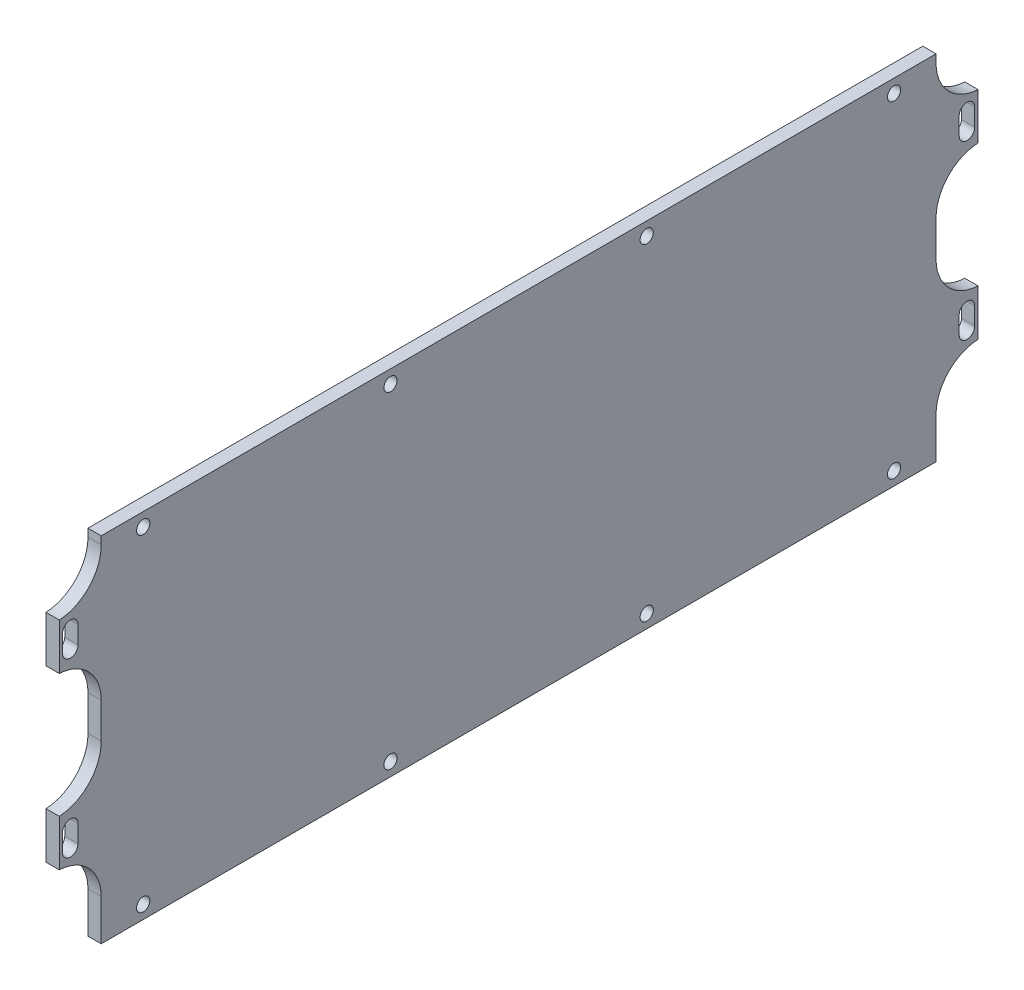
ISO-10303-21;
HEADER;
FILE_DESCRIPTION(('STEP AP214'),'2;1');
FILE_NAME('part.step','',(''),(''),'','','');
FILE_SCHEMA(('AUTOMOTIVE_DESIGN { 1 0 10303 214 1 1 1 1 }'));
ENDSEC;
DATA;
#1=APPLICATION_CONTEXT('core data for automotive mechanical design processes');
#2=APPLICATION_PROTOCOL_DEFINITION('international standard','automotive_design',2000,#1);
#3=PRODUCT_CONTEXT('',#1,'mechanical');
#4=PRODUCT('Part','Part','',(#3));
#5=PRODUCT_RELATED_PRODUCT_CATEGORY('part','',(#4));
#6=PRODUCT_DEFINITION_FORMATION('','',#4);
#7=PRODUCT_DEFINITION_CONTEXT('part definition',#1,'design');
#8=PRODUCT_DEFINITION('design','',#6,#7);
#9=PRODUCT_DEFINITION_SHAPE('','',#8);
#10=(LENGTH_UNIT() NAMED_UNIT(*) SI_UNIT(.MILLI.,.METRE.));
#11=(NAMED_UNIT(*) PLANE_ANGLE_UNIT() SI_UNIT($,.RADIAN.));
#12=(NAMED_UNIT(*) SI_UNIT($,.STERADIAN.) SOLID_ANGLE_UNIT());
#13=UNCERTAINTY_MEASURE_WITH_UNIT(LENGTH_MEASURE(1.E-05),#10,'distance_accuracy_value','');
#14=(GEOMETRIC_REPRESENTATION_CONTEXT(3) GLOBAL_UNCERTAINTY_ASSIGNED_CONTEXT((#13)) GLOBAL_UNIT_ASSIGNED_CONTEXT((#10,
#11,#12)) REPRESENTATION_CONTEXT('',''));
#15=CARTESIAN_POINT('',(0.,0.,0.));
#16=DIRECTION('',(0.,0.,1.));
#17=DIRECTION('',(1.,0.,0.));
#18=AXIS2_PLACEMENT_3D('',#15,#16,#17);
#19=CARTESIAN_POINT('',(-7.,21.25,-101.5));
#20=DIRECTION('',(1.,0.,0.));
#21=DIRECTION('',(0.,0.,-1.));
#22=AXIS2_PLACEMENT_3D('',#19,#20,#21);
#23=CYLINDRICAL_SURFACE('',#22,1.75);
#24=DIRECTION('',(1.,0.,0.));
#25=VECTOR('',#24,1.);
#26=CARTESIAN_POINT('',(0.,21.2500000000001,-99.75));
#27=LINE('',#26,#25);
#28=CARTESIAN_POINT('',(0.,21.2500000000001,-99.75));
#29=VERTEX_POINT('',#28);
#30=CARTESIAN_POINT('',(3.,21.2500000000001,-99.75));
#31=VERTEX_POINT('',#30);
#32=EDGE_CURVE('E301',#29,#31,#27,.T.);
#33=ORIENTED_EDGE('',*,*,#32,.T.);
#34=CARTESIAN_POINT('',(3.,21.25,-101.5));
#35=DIRECTION('',(1.,0.,0.));
#36=DIRECTION('',(0.,0.,-1.));
#37=AXIS2_PLACEMENT_3D('',#34,#35,#36);
#38=CIRCLE('',#37,1.75);
#39=CARTESIAN_POINT('',(3.,21.2500000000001,-103.25));
#40=VERTEX_POINT('',#39);
#41=EDGE_CURVE('E482',#31,#40,#38,.T.);
#42=ORIENTED_EDGE('',*,*,#41,.T.);
#43=DIRECTION('',(1.,0.,0.));
#44=VECTOR('',#43,1.);
#45=CARTESIAN_POINT('',(0.,21.2500000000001,-103.25));
#46=LINE('',#45,#44);
#47=CARTESIAN_POINT('',(0.,21.25,-103.25));
#48=VERTEX_POINT('',#47);
#49=EDGE_CURVE('E277',#48,#40,#46,.T.);
#50=ORIENTED_EDGE('',*,*,#49,.F.);
#51=CARTESIAN_POINT('',(0.,21.25,-101.5));
#52=DIRECTION('',(-1.,0.,0.));
#53=DIRECTION('',(0.,0.,1.));
#54=AXIS2_PLACEMENT_3D('',#51,#52,#53);
#55=CIRCLE('',#54,1.75);
#56=EDGE_CURVE('E291',#48,#29,#55,.T.);
#57=ORIENTED_EDGE('',*,*,#56,.T.);
#58=EDGE_LOOP('',(#33,#42,#50,#57));
#59=FACE_BOUND('',#58,.T.);
#60=ADVANCED_FACE('F34',(#59),#23,.F.);
#61=CARTESIAN_POINT('',(-7.,-17.75,-101.5));
#62=DIRECTION('',(1.,0.,0.));
#63=DIRECTION('',(0.,0.,-1.));
#64=AXIS2_PLACEMENT_3D('',#61,#62,#63);
#65=CYLINDRICAL_SURFACE('',#64,1.75);
#66=DIRECTION('',(1.,0.,0.));
#67=VECTOR('',#66,1.);
#68=CARTESIAN_POINT('',(0.,-17.75,-99.75));
#69=LINE('',#68,#67);
#70=CARTESIAN_POINT('',(0.,-17.75,-99.75));
#71=VERTEX_POINT('',#70);
#72=CARTESIAN_POINT('',(3.,-17.75,-99.75));
#73=VERTEX_POINT('',#72);
#74=EDGE_CURVE('E322',#71,#73,#69,.T.);
#75=ORIENTED_EDGE('',*,*,#74,.T.);
#76=CARTESIAN_POINT('',(3.,-17.75,-101.5));
#77=DIRECTION('',(1.,0.,0.));
#78=DIRECTION('',(0.,0.,-1.));
#79=AXIS2_PLACEMENT_3D('',#76,#77,#78);
#80=CIRCLE('',#79,1.75);
#81=CARTESIAN_POINT('',(3.,-17.75,-103.25));
#82=VERTEX_POINT('',#81);
#83=EDGE_CURVE('E473',#73,#82,#80,.T.);
#84=ORIENTED_EDGE('',*,*,#83,.T.);
#85=DIRECTION('',(1.,0.,0.));
#86=VECTOR('',#85,1.);
#87=CARTESIAN_POINT('',(0.,-17.75,-103.25));
#88=LINE('',#87,#86);
#89=CARTESIAN_POINT('',(0.,-17.75,-103.25));
#90=VERTEX_POINT('',#89);
#91=EDGE_CURVE('E343',#90,#82,#88,.T.);
#92=ORIENTED_EDGE('',*,*,#91,.F.);
#93=CARTESIAN_POINT('',(0.,-17.75,-101.5));
#94=DIRECTION('',(-1.,0.,0.));
#95=DIRECTION('',(0.,0.,1.));
#96=AXIS2_PLACEMENT_3D('',#93,#94,#95);
#97=CIRCLE('',#96,1.75);
#98=EDGE_CURVE('E485',#90,#71,#97,.T.);
#99=ORIENTED_EDGE('',*,*,#98,.T.);
#100=EDGE_LOOP('',(#75,#84,#92,#99));
#101=FACE_BOUND('',#100,.T.);
#102=ADVANCED_FACE('F684',(#101),#65,.F.);
#103=CARTESIAN_POINT('',(3.,0.,0.));
#104=DIRECTION('',(-1.,0.,0.));
#105=DIRECTION('',(0.,0.,1.));
#106=AXIS2_PLACEMENT_3D('',#103,#104,#105);
#107=PLANE('',#106);
#108=DIRECTION('',(0.,-1.,0.));
#109=VECTOR('',#108,1.);
#110=CARTESIAN_POINT('',(3.,0.,-104.));
#111=LINE('',#110,#109);
#112=CARTESIAN_POINT('',(3.,-10.25,-104.));
#113=VERTEX_POINT('',#112);
#114=CARTESIAN_POINT('',(3.,-20.75,-104.));
#115=VERTEX_POINT('',#114);
#116=EDGE_CURVE('E402',#113,#115,#111,.T.);
#117=ORIENTED_EDGE('',*,*,#116,.F.);
#118=CARTESIAN_POINT('',(3.,-0.262507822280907,-104.5));
#119=DIRECTION('',(-1.,0.,0.));
#120=DIRECTION('',(0.,0.,1.));
#121=AXIS2_PLACEMENT_3D('',#118,#119,#120);
#122=CIRCLE('',#121,10.);
#123=CARTESIAN_POINT('',(3.,-0.262507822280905,-94.5));
#124=VERTEX_POINT('',#123);
#125=EDGE_CURVE('E562',#113,#124,#122,.T.);
#126=ORIENTED_EDGE('',*,*,#125,.T.);
#127=DIRECTION('',(0.,-1.,0.));
#128=VECTOR('',#127,1.);
#129=CARTESIAN_POINT('',(3.,17.75,-94.5));
#130=LINE('',#129,#128);
#131=CARTESIAN_POINT('',(3.,7.76250782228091,-94.5));
#132=VERTEX_POINT('',#131);
#133=EDGE_CURVE('E445',#132,#124,#130,.T.);
#134=ORIENTED_EDGE('',*,*,#133,.F.);
#135=CARTESIAN_POINT('',(3.,7.76250782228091,-104.5));
#136=DIRECTION('',(-1.,0.,0.));
#137=DIRECTION('',(0.,0.,1.));
#138=AXIS2_PLACEMENT_3D('',#135,#136,#137);
#139=CIRCLE('',#138,10.);
#140=CARTESIAN_POINT('',(3.,17.75,-104.));
#141=VERTEX_POINT('',#140);
#142=EDGE_CURVE('E566',#132,#141,#139,.T.);
#143=ORIENTED_EDGE('',*,*,#142,.T.);
#144=CARTESIAN_POINT('',(3.,28.2499999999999,-104.));
#145=VERTEX_POINT('',#144);
#146=EDGE_CURVE('E398',#145,#141,#111,.T.);
#147=ORIENTED_EDGE('',*,*,#146,.F.);
#148=CARTESIAN_POINT('',(3.,38.237492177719,-104.5));
#149=DIRECTION('',(-1.,0.,0.));
#150=DIRECTION('',(0.,0.,1.));
#151=AXIS2_PLACEMENT_3D('',#148,#149,#150);
#152=CIRCLE('',#151,10.);
#153=CARTESIAN_POINT('',(3.,38.237492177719,-94.5));
#154=VERTEX_POINT('',#153);
#155=EDGE_CURVE('E570',#145,#154,#152,.T.);
#156=ORIENTED_EDGE('',*,*,#155,.T.);
#157=DIRECTION('',(0.,-1.,0.));
#158=VECTOR('',#157,1.);
#159=CARTESIAN_POINT('',(3.,24.25,-94.5));
#160=LINE('',#159,#158);
#161=CARTESIAN_POINT('',(3.,40.,-94.5));
#162=VERTEX_POINT('',#161);
#163=EDGE_CURVE('E462',#162,#154,#160,.T.);
#164=ORIENTED_EDGE('',*,*,#163,.F.);
#165=DIRECTION('',(0.,0.,-1.));
#166=VECTOR('',#165,1.);
#167=CARTESIAN_POINT('',(3.,40.,0.));
#168=LINE('',#167,#166);
#169=CARTESIAN_POINT('',(3.,40.,94.5));
#170=VERTEX_POINT('',#169);
#171=EDGE_CURVE('E467',#170,#162,#168,.T.);
#172=ORIENTED_EDGE('',*,*,#171,.F.);
#173=DIRECTION('',(0.,1.,0.));
#174=VECTOR('',#173,1.);
#175=CARTESIAN_POINT('',(3.,24.25,94.5));
#176=LINE('',#175,#174);
#177=CARTESIAN_POINT('',(3.,38.2374921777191,94.5));
#178=VERTEX_POINT('',#177);
#179=EDGE_CURVE('E448',#178,#170,#176,.T.);
#180=ORIENTED_EDGE('',*,*,#179,.F.);
#181=CARTESIAN_POINT('',(3.,38.2374921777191,104.5));
#182=DIRECTION('',(-1.,0.,0.));
#183=DIRECTION('',(0.,0.,1.));
#184=AXIS2_PLACEMENT_3D('',#181,#182,#183);
#185=CIRCLE('',#184,10.);
#186=CARTESIAN_POINT('',(3.,28.25,104.));
#187=VERTEX_POINT('',#186);
#188=EDGE_CURVE('E11',#178,#187,#185,.T.);
#189=ORIENTED_EDGE('',*,*,#188,.T.);
#190=DIRECTION('',(0.,1.,0.));
#191=VECTOR('',#190,1.);
#192=CARTESIAN_POINT('',(3.,0.,104.));
#193=LINE('',#192,#191);
#194=CARTESIAN_POINT('',(3.,17.75,104.));
#195=VERTEX_POINT('',#194);
#196=EDGE_CURVE('E407',#195,#187,#193,.T.);
#197=ORIENTED_EDGE('',*,*,#196,.F.);
#198=CARTESIAN_POINT('',(3.,7.76250782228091,104.5));
#199=DIRECTION('',(-1.,0.,0.));
#200=DIRECTION('',(0.,0.,1.));
#201=AXIS2_PLACEMENT_3D('',#198,#199,#200);
#202=CIRCLE('',#201,10.);
#203=CARTESIAN_POINT('',(3.,7.76250782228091,94.5));
#204=VERTEX_POINT('',#203);
#205=EDGE_CURVE('E582',#195,#204,#202,.T.);
#206=ORIENTED_EDGE('',*,*,#205,.T.);
#207=DIRECTION('',(0.,1.,0.));
#208=VECTOR('',#207,1.);
#209=CARTESIAN_POINT('',(3.,17.75,94.5));
#210=LINE('',#209,#208);
#211=CARTESIAN_POINT('',(3.,-0.262507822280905,94.5));
#212=VERTEX_POINT('',#211);
#213=EDGE_CURVE('E442',#212,#204,#210,.T.);
#214=ORIENTED_EDGE('',*,*,#213,.F.);
#215=CARTESIAN_POINT('',(3.,-0.262507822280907,104.5));
#216=DIRECTION('',(-1.,0.,0.));
#217=DIRECTION('',(0.,0.,1.));
#218=AXIS2_PLACEMENT_3D('',#215,#216,#217);
#219=CIRCLE('',#218,10.);
#220=CARTESIAN_POINT('',(3.,-10.25,104.));
#221=VERTEX_POINT('',#220);
#222=EDGE_CURVE('E580',#212,#221,#219,.T.);
#223=ORIENTED_EDGE('',*,*,#222,.T.);
#224=CARTESIAN_POINT('',(3.,-20.75,104.));
#225=VERTEX_POINT('',#224);
#226=EDGE_CURVE('E411',#225,#221,#193,.T.);
#227=ORIENTED_EDGE('',*,*,#226,.F.);
#228=CARTESIAN_POINT('',(3.,-30.7374921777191,104.5));
#229=DIRECTION('',(-1.,0.,0.));
#230=DIRECTION('',(0.,0.,1.));
#231=AXIS2_PLACEMENT_3D('',#228,#229,#230);
#232=CIRCLE('',#231,10.);
#233=CARTESIAN_POINT('',(3.,-30.7374921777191,94.5));
#234=VERTEX_POINT('',#233);
#235=EDGE_CURVE('E574',#225,#234,#232,.T.);
#236=ORIENTED_EDGE('',*,*,#235,.T.);
#237=DIRECTION('',(0.,1.,0.));
#238=VECTOR('',#237,1.);
#239=CARTESIAN_POINT('',(3.,-20.75,94.5));
#240=LINE('',#239,#238);
#241=CARTESIAN_POINT('',(3.,-40.,94.5));
#242=VERTEX_POINT('',#241);
#243=EDGE_CURVE('E452',#242,#234,#240,.T.);
#244=ORIENTED_EDGE('',*,*,#243,.F.);
#245=DIRECTION('',(0.,0.,1.));
#246=VECTOR('',#245,1.);
#247=CARTESIAN_POINT('',(3.,-40.,0.));
#248=LINE('',#247,#246);
#249=CARTESIAN_POINT('',(3.,-40.,-94.5));
#250=VERTEX_POINT('',#249);
#251=EDGE_CURVE('E469',#250,#242,#248,.T.);
#252=ORIENTED_EDGE('',*,*,#251,.F.);
#253=DIRECTION('',(0.,-1.,0.));
#254=VECTOR('',#253,1.);
#255=CARTESIAN_POINT('',(3.,-20.75,-94.5));
#256=LINE('',#255,#254);
#257=CARTESIAN_POINT('',(3.,-30.7374921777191,-94.5));
#258=VERTEX_POINT('',#257);
#259=EDGE_CURVE('E449',#258,#250,#256,.T.);
#260=ORIENTED_EDGE('',*,*,#259,.F.);
#261=CARTESIAN_POINT('',(3.,-30.7374921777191,-104.5));
#262=DIRECTION('',(-1.,0.,0.));
#263=DIRECTION('',(0.,0.,1.));
#264=AXIS2_PLACEMENT_3D('',#261,#262,#263);
#265=CIRCLE('',#264,10.);
#266=EDGE_CURVE('E558',#258,#115,#265,.T.);
#267=ORIENTED_EDGE('',*,*,#266,.T.);
#268=EDGE_LOOP('',(#117,#126,#134,#143,#147,#156,#164,#172,#180,#189,#197,#206,#214,#223,#227,
#236,#244,#252,#260,#267));
#269=FACE_BOUND('',#268,.T.);
#270=CARTESIAN_POINT('',(3.,37.,85.));
#271=DIRECTION('',(1.,0.,0.));
#272=DIRECTION('',(0.,0.,-1.));
#273=AXIS2_PLACEMENT_3D('',#270,#271,#272);
#274=CIRCLE('',#273,1.5);
#275=CARTESIAN_POINT('',(3.,37.,83.5));
#276=VERTEX_POINT('',#275);
#277=EDGE_CURVE('E416',#276,#276,#274,.T.);
#278=ORIENTED_EDGE('',*,*,#277,.F.);
#279=EDGE_LOOP('',(#278));
#280=FACE_BOUND('',#279,.T.);
#281=CARTESIAN_POINT('',(3.,37.,-85.));
#282=DIRECTION('',(1.,0.,0.));
#283=DIRECTION('',(0.,0.,1.));
#284=AXIS2_PLACEMENT_3D('',#281,#282,#283);
#285=CIRCLE('',#284,1.5);
#286=CARTESIAN_POINT('',(3.,37.,-83.5));
#287=VERTEX_POINT('',#286);
#288=EDGE_CURVE('E420',#287,#287,#285,.T.);
#289=ORIENTED_EDGE('',*,*,#288,.F.);
#290=EDGE_LOOP('',(#289));
#291=FACE_BOUND('',#290,.T.);
#292=CARTESIAN_POINT('',(3.,37.,-29.));
#293=DIRECTION('',(1.,0.,0.));
#294=DIRECTION('',(0.,0.,1.));
#295=AXIS2_PLACEMENT_3D('',#292,#293,#294);
#296=CIRCLE('',#295,1.5);
#297=CARTESIAN_POINT('',(3.,37.,-27.5));
#298=VERTEX_POINT('',#297);
#299=EDGE_CURVE('E423',#298,#298,#296,.T.);
#300=ORIENTED_EDGE('',*,*,#299,.F.);
#301=EDGE_LOOP('',(#300));
#302=FACE_BOUND('',#301,.T.);
#303=CARTESIAN_POINT('',(3.,-37.,85.));
#304=DIRECTION('',(1.,0.,0.));
#305=DIRECTION('',(0.,0.,1.));
#306=AXIS2_PLACEMENT_3D('',#303,#304,#305);
#307=CIRCLE('',#306,1.5);
#308=CARTESIAN_POINT('',(3.,-37.,86.5));
#309=VERTEX_POINT('',#308);
#310=EDGE_CURVE('E426',#309,#309,#307,.T.);
#311=ORIENTED_EDGE('',*,*,#310,.F.);
#312=EDGE_LOOP('',(#311));
#313=FACE_BOUND('',#312,.T.);
#314=CARTESIAN_POINT('',(3.,-37.,29.));
#315=DIRECTION('',(1.,0.,0.));
#316=DIRECTION('',(0.,0.,1.));
#317=AXIS2_PLACEMENT_3D('',#314,#315,#316);
#318=CIRCLE('',#317,1.5);
#319=CARTESIAN_POINT('',(3.,-37.,30.5));
#320=VERTEX_POINT('',#319);
#321=EDGE_CURVE('E429',#320,#320,#318,.T.);
#322=ORIENTED_EDGE('',*,*,#321,.F.);
#323=EDGE_LOOP('',(#322));
#324=FACE_BOUND('',#323,.T.);
#325=CARTESIAN_POINT('',(3.,-37.,-29.));
#326=DIRECTION('',(1.,0.,0.));
#327=DIRECTION('',(0.,0.,-1.));
#328=AXIS2_PLACEMENT_3D('',#325,#326,#327);
#329=CIRCLE('',#328,1.5);
#330=CARTESIAN_POINT('',(3.,-37.,-30.5));
#331=VERTEX_POINT('',#330);
#332=EDGE_CURVE('E432',#331,#331,#329,.T.);
#333=ORIENTED_EDGE('',*,*,#332,.F.);
#334=EDGE_LOOP('',(#333));
#335=FACE_BOUND('',#334,.T.);
#336=CARTESIAN_POINT('',(3.,-37.,-85.));
#337=DIRECTION('',(1.,0.,0.));
#338=DIRECTION('',(0.,0.,-1.));
#339=AXIS2_PLACEMENT_3D('',#336,#337,#338);
#340=CIRCLE('',#339,1.5);
#341=CARTESIAN_POINT('',(3.,-37.,-86.5));
#342=VERTEX_POINT('',#341);
#343=EDGE_CURVE('E415',#342,#342,#340,.T.);
#344=ORIENTED_EDGE('',*,*,#343,.F.);
#345=EDGE_LOOP('',(#344));
#346=FACE_BOUND('',#345,.T.);
#347=CARTESIAN_POINT('',(3.,37.,29.));
#348=DIRECTION('',(1.,0.,0.));
#349=DIRECTION('',(0.,0.,-1.));
#350=AXIS2_PLACEMENT_3D('',#347,#348,#349);
#351=CIRCLE('',#350,1.5);
#352=CARTESIAN_POINT('',(3.,37.,27.5));
#353=VERTEX_POINT('',#352);
#354=EDGE_CURVE('E437',#353,#353,#351,.T.);
#355=ORIENTED_EDGE('',*,*,#354,.F.);
#356=EDGE_LOOP('',(#355));
#357=FACE_BOUND('',#356,.T.);
#358=ORIENTED_EDGE('',*,*,#83,.F.);
#359=DIRECTION('',(0.,-1.,0.));
#360=VECTOR('',#359,1.);
#361=CARTESIAN_POINT('',(3.,-13.75,-99.75));
#362=LINE('',#361,#360);
#363=CARTESIAN_POINT('',(3.,-13.75,-99.75));
#364=VERTEX_POINT('',#363);
#365=EDGE_CURVE('E337',#364,#73,#362,.T.);
#366=ORIENTED_EDGE('',*,*,#365,.F.);
#367=CARTESIAN_POINT('',(3.,-13.75,-101.5));
#368=DIRECTION('',(1.,0.,0.));
#369=DIRECTION('',(0.,0.,1.));
#370=AXIS2_PLACEMENT_3D('',#367,#368,#369);
#371=CIRCLE('',#370,1.75);
#372=CARTESIAN_POINT('',(3.,-13.75,-103.25));
#373=VERTEX_POINT('',#372);
#374=EDGE_CURVE('E347',#373,#364,#371,.T.);
#375=ORIENTED_EDGE('',*,*,#374,.F.);
#376=DIRECTION('',(0.,1.,0.));
#377=VECTOR('',#376,1.);
#378=CARTESIAN_POINT('',(3.,-13.75,-103.25));
#379=LINE('',#378,#377);
#380=EDGE_CURVE('E344',#82,#373,#379,.T.);
#381=ORIENTED_EDGE('',*,*,#380,.F.);
#382=EDGE_LOOP('',(#358,#366,#375,#381));
#383=FACE_BOUND('',#382,.T.);
#384=CARTESIAN_POINT('',(3.,-13.75,101.5));
#385=DIRECTION('',(1.,0.,0.));
#386=DIRECTION('',(0.,0.,-1.));
#387=AXIS2_PLACEMENT_3D('',#384,#385,#386);
#388=CIRCLE('',#387,1.75);
#389=CARTESIAN_POINT('',(3.,-13.75,99.75));
#390=VERTEX_POINT('',#389);
#391=CARTESIAN_POINT('',(3.,-13.75,103.25));
#392=VERTEX_POINT('',#391);
#393=EDGE_CURVE('E318',#390,#392,#388,.T.);
#394=ORIENTED_EDGE('',*,*,#393,.F.);
#395=DIRECTION('',(0.,1.,0.));
#396=VECTOR('',#395,1.);
#397=CARTESIAN_POINT('',(3.,-13.75,99.75));
#398=LINE('',#397,#396);
#399=CARTESIAN_POINT('',(3.,-17.75,99.75));
#400=VERTEX_POINT('',#399);
#401=EDGE_CURVE('E311',#400,#390,#398,.T.);
#402=ORIENTED_EDGE('',*,*,#401,.F.);
#403=CARTESIAN_POINT('',(3.,-17.75,101.5));
#404=DIRECTION('',(1.,0.,0.));
#405=DIRECTION('',(0.,0.,1.));
#406=AXIS2_PLACEMENT_3D('',#403,#404,#405);
#407=CIRCLE('',#406,1.75);
#408=CARTESIAN_POINT('',(3.,-17.75,103.25));
#409=VERTEX_POINT('',#408);
#410=EDGE_CURVE('E477',#409,#400,#407,.T.);
#411=ORIENTED_EDGE('',*,*,#410,.F.);
#412=DIRECTION('',(0.,-1.,0.));
#413=VECTOR('',#412,1.);
#414=CARTESIAN_POINT('',(3.,-13.75,103.25));
#415=LINE('',#414,#413);
#416=EDGE_CURVE('E321',#392,#409,#415,.T.);
#417=ORIENTED_EDGE('',*,*,#416,.F.);
#418=EDGE_LOOP('',(#394,#402,#411,#417));
#419=FACE_BOUND('',#418,.T.);
#420=CARTESIAN_POINT('',(3.,25.2500000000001,101.5));
#421=DIRECTION('',(1.,0.,0.));
#422=DIRECTION('',(0.,0.,-1.));
#423=AXIS2_PLACEMENT_3D('',#420,#421,#422);
#424=CIRCLE('',#423,1.75);
#425=CARTESIAN_POINT('',(3.,25.2500000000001,99.75));
#426=VERTEX_POINT('',#425);
#427=CARTESIAN_POINT('',(3.,25.2500000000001,103.25));
#428=VERTEX_POINT('',#427);
#429=EDGE_CURVE('E304',#426,#428,#424,.T.);
#430=ORIENTED_EDGE('',*,*,#429,.F.);
#431=DIRECTION('',(0.,1.,0.));
#432=VECTOR('',#431,1.);
#433=CARTESIAN_POINT('',(3.,25.2500000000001,99.75));
#434=LINE('',#433,#432);
#435=CARTESIAN_POINT('',(3.,21.2500000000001,99.75));
#436=VERTEX_POINT('',#435);
#437=EDGE_CURVE('E362',#436,#426,#434,.T.);
#438=ORIENTED_EDGE('',*,*,#437,.F.);
#439=CARTESIAN_POINT('',(3.,21.2500000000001,101.5));
#440=DIRECTION('',(1.,0.,0.));
#441=DIRECTION('',(0.,0.,1.));
#442=AXIS2_PLACEMENT_3D('',#439,#440,#441);
#443=CIRCLE('',#442,1.75);
#444=CARTESIAN_POINT('',(3.,21.2500000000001,103.25));
#445=VERTEX_POINT('',#444);
#446=EDGE_CURVE('E472',#445,#436,#443,.T.);
#447=ORIENTED_EDGE('',*,*,#446,.F.);
#448=DIRECTION('',(0.,-1.,0.));
#449=VECTOR('',#448,1.);
#450=CARTESIAN_POINT('',(3.,25.2500000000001,103.25));
#451=LINE('',#450,#449);
#452=EDGE_CURVE('E371',#428,#445,#451,.T.);
#453=ORIENTED_EDGE('',*,*,#452,.F.);
#454=EDGE_LOOP('',(#430,#438,#447,#453));
#455=FACE_BOUND('',#454,.T.);
#456=ORIENTED_EDGE('',*,*,#41,.F.);
#457=DIRECTION('',(0.,-1.,0.));
#458=VECTOR('',#457,1.);
#459=CARTESIAN_POINT('',(3.,25.2500000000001,-99.75));
#460=LINE('',#459,#458);
#461=CARTESIAN_POINT('',(3.,25.2500000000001,-99.75));
#462=VERTEX_POINT('',#461);
#463=EDGE_CURVE('E292',#462,#31,#460,.T.);
#464=ORIENTED_EDGE('',*,*,#463,.F.);
#465=CARTESIAN_POINT('',(3.,25.2500000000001,-101.5));
#466=DIRECTION('',(1.,0.,0.));
#467=DIRECTION('',(0.,0.,1.));
#468=AXIS2_PLACEMENT_3D('',#465,#466,#467);
#469=CIRCLE('',#468,1.75);
#470=CARTESIAN_POINT('',(3.,25.2500000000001,-103.25));
#471=VERTEX_POINT('',#470);
#472=EDGE_CURVE('E294',#471,#462,#469,.T.);
#473=ORIENTED_EDGE('',*,*,#472,.F.);
#474=DIRECTION('',(0.,1.,0.));
#475=VECTOR('',#474,1.);
#476=CARTESIAN_POINT('',(3.,25.2500000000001,-103.25));
#477=LINE('',#476,#475);
#478=EDGE_CURVE('E272',#40,#471,#477,.T.);
#479=ORIENTED_EDGE('',*,*,#478,.F.);
#480=EDGE_LOOP('',(#456,#464,#473,#479));
#481=FACE_BOUND('',#480,.T.);
#482=ADVANCED_FACE('F601',(#269,#280,#291,#302,#313,#324,#335,#346,#357,#383,#419,#455,#481),
#107,.F.);
#483=CARTESIAN_POINT('',(0.,0.,0.));
#484=DIRECTION('',(-1.,0.,0.));
#485=DIRECTION('',(0.,0.,1.));
#486=AXIS2_PLACEMENT_3D('',#483,#484,#485);
#487=PLANE('',#486);
#488=DIRECTION('',(0.,-1.,0.));
#489=VECTOR('',#488,1.);
#490=CARTESIAN_POINT('',(0.,25.2500000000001,-99.75));
#491=LINE('',#490,#489);
#492=CARTESIAN_POINT('',(0.,25.2500000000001,-99.75));
#493=VERTEX_POINT('',#492);
#494=EDGE_CURVE('E285',#493,#29,#491,.T.);
#495=ORIENTED_EDGE('',*,*,#494,.T.);
#496=ORIENTED_EDGE('',*,*,#56,.F.);
#497=DIRECTION('',(0.,1.,0.));
#498=VECTOR('',#497,1.);
#499=CARTESIAN_POINT('',(0.,25.2500000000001,-103.25));
#500=LINE('',#499,#498);
#501=CARTESIAN_POINT('',(0.,25.2500000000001,-103.25));
#502=VERTEX_POINT('',#501);
#503=EDGE_CURVE('E269',#48,#502,#500,.T.);
#504=ORIENTED_EDGE('',*,*,#503,.T.);
#505=CARTESIAN_POINT('',(0.,25.2500000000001,-101.5));
#506=DIRECTION('',(1.,0.,0.));
#507=DIRECTION('',(0.,0.,1.));
#508=AXIS2_PLACEMENT_3D('',#505,#506,#507);
#509=CIRCLE('',#508,1.75);
#510=EDGE_CURVE('E280',#502,#493,#509,.T.);
#511=ORIENTED_EDGE('',*,*,#510,.T.);
#512=EDGE_LOOP('',(#495,#496,#504,#511));
#513=FACE_BOUND('',#512,.T.);
#514=DIRECTION('',(0.,1.,0.));
#515=VECTOR('',#514,1.);
#516=CARTESIAN_POINT('',(0.,-13.75,99.75));
#517=LINE('',#516,#515);
#518=CARTESIAN_POINT('',(0.,-17.75,99.75));
#519=VERTEX_POINT('',#518);
#520=CARTESIAN_POINT('',(0.,-13.75,99.75));
#521=VERTEX_POINT('',#520);
#522=EDGE_CURVE('E314',#519,#521,#517,.T.);
#523=ORIENTED_EDGE('',*,*,#522,.T.);
#524=CARTESIAN_POINT('',(0.,-13.75,101.5));
#525=DIRECTION('',(1.,0.,0.));
#526=DIRECTION('',(0.,0.,-1.));
#527=AXIS2_PLACEMENT_3D('',#524,#525,#526);
#528=CIRCLE('',#527,1.75);
#529=CARTESIAN_POINT('',(0.,-13.75,103.25));
#530=VERTEX_POINT('',#529);
#531=EDGE_CURVE('E307',#521,#530,#528,.T.);
#532=ORIENTED_EDGE('',*,*,#531,.T.);
#533=DIRECTION('',(0.,-1.,0.));
#534=VECTOR('',#533,1.);
#535=CARTESIAN_POINT('',(0.,-13.75,103.25));
#536=LINE('',#535,#534);
#537=CARTESIAN_POINT('',(0.,-17.75,103.25));
#538=VERTEX_POINT('',#537);
#539=EDGE_CURVE('E310',#530,#538,#536,.T.);
#540=ORIENTED_EDGE('',*,*,#539,.T.);
#541=CARTESIAN_POINT('',(0.,-17.75,101.5));
#542=DIRECTION('',(-1.,0.,0.));
#543=DIRECTION('',(0.,0.,1.));
#544=AXIS2_PLACEMENT_3D('',#541,#542,#543);
#545=CIRCLE('',#544,1.75);
#546=EDGE_CURVE('E490',#519,#538,#545,.T.);
#547=ORIENTED_EDGE('',*,*,#546,.F.);
#548=EDGE_LOOP('',(#523,#532,#540,#547));
#549=FACE_BOUND('',#548,.T.);
#550=DIRECTION('',(0.,-1.,0.));
#551=VECTOR('',#550,1.);
#552=CARTESIAN_POINT('',(0.,-13.75,-99.75));
#553=LINE('',#552,#551);
#554=CARTESIAN_POINT('',(0.,-13.75,-99.75));
#555=VERTEX_POINT('',#554);
#556=EDGE_CURVE('E340',#555,#71,#553,.T.);
#557=ORIENTED_EDGE('',*,*,#556,.T.);
#558=ORIENTED_EDGE('',*,*,#98,.F.);
#559=DIRECTION('',(0.,1.,0.));
#560=VECTOR('',#559,1.);
#561=CARTESIAN_POINT('',(0.,-13.75,-103.25));
#562=LINE('',#561,#560);
#563=CARTESIAN_POINT('',(0.,-13.75,-103.25));
#564=VERTEX_POINT('',#563);
#565=EDGE_CURVE('E333',#90,#564,#562,.T.);
#566=ORIENTED_EDGE('',*,*,#565,.T.);
#567=CARTESIAN_POINT('',(0.,-13.75,-101.5));
#568=DIRECTION('',(1.,0.,0.));
#569=DIRECTION('',(0.,0.,1.));
#570=AXIS2_PLACEMENT_3D('',#567,#568,#569);
#571=CIRCLE('',#570,1.75);
#572=EDGE_CURVE('E336',#564,#555,#571,.T.);
#573=ORIENTED_EDGE('',*,*,#572,.T.);
#574=EDGE_LOOP('',(#557,#558,#566,#573));
#575=FACE_BOUND('',#574,.T.);
#576=DIRECTION('',(0.,1.,0.));
#577=VECTOR('',#576,1.);
#578=CARTESIAN_POINT('',(0.,25.2500000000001,99.75));
#579=LINE('',#578,#577);
#580=CARTESIAN_POINT('',(0.,21.2500000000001,99.75));
#581=VERTEX_POINT('',#580);
#582=CARTESIAN_POINT('',(0.,25.2500000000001,99.75));
#583=VERTEX_POINT('',#582);
#584=EDGE_CURVE('E365',#581,#583,#579,.T.);
#585=ORIENTED_EDGE('',*,*,#584,.T.);
#586=CARTESIAN_POINT('',(0.,25.2500000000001,101.5));
#587=DIRECTION('',(1.,0.,0.));
#588=DIRECTION('',(0.,0.,-1.));
#589=AXIS2_PLACEMENT_3D('',#586,#587,#588);
#590=CIRCLE('',#589,1.75);
#591=CARTESIAN_POINT('',(0.,25.2500000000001,103.25));
#592=VERTEX_POINT('',#591);
#593=EDGE_CURVE('E358',#583,#592,#590,.T.);
#594=ORIENTED_EDGE('',*,*,#593,.T.);
#595=DIRECTION('',(0.,-1.,0.));
#596=VECTOR('',#595,1.);
#597=CARTESIAN_POINT('',(0.,25.2500000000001,103.25));
#598=LINE('',#597,#596);
#599=CARTESIAN_POINT('',(0.,21.2500000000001,103.25));
#600=VERTEX_POINT('',#599);
#601=EDGE_CURVE('E361',#592,#600,#598,.T.);
#602=ORIENTED_EDGE('',*,*,#601,.T.);
#603=CARTESIAN_POINT('',(0.,21.2500000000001,101.5));
#604=DIRECTION('',(-1.,0.,0.));
#605=DIRECTION('',(0.,0.,1.));
#606=AXIS2_PLACEMENT_3D('',#603,#604,#605);
#607=CIRCLE('',#606,1.75);
#608=EDGE_CURVE('E476',#581,#600,#607,.T.);
#609=ORIENTED_EDGE('',*,*,#608,.F.);
#610=EDGE_LOOP('',(#585,#594,#602,#609));
#611=FACE_BOUND('',#610,.T.);
#612=DIRECTION('',(0.,1.,0.));
#613=VECTOR('',#612,1.);
#614=CARTESIAN_POINT('',(0.,0.,104.));
#615=LINE('',#614,#613);
#616=CARTESIAN_POINT('',(0.,-20.75,104.));
#617=VERTEX_POINT('',#616);
#618=CARTESIAN_POINT('',(0.,-10.25,104.));
#619=VERTEX_POINT('',#618);
#620=EDGE_CURVE('E408',#617,#619,#615,.T.);
#621=ORIENTED_EDGE('',*,*,#620,.T.);
#622=CARTESIAN_POINT('',(0.,-0.262507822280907,104.5));
#623=DIRECTION('',(-1.,0.,0.));
#624=DIRECTION('',(0.,0.,1.));
#625=AXIS2_PLACEMENT_3D('',#622,#623,#624);
#626=CIRCLE('',#625,10.);
#627=CARTESIAN_POINT('',(0.,-0.262507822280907,94.5));
#628=VERTEX_POINT('',#627);
#629=EDGE_CURVE('E578',#619,#628,#626,.F.);
#630=ORIENTED_EDGE('',*,*,#629,.T.);
#631=DIRECTION('',(0.,-1.,0.));
#632=VECTOR('',#631,1.);
#633=CARTESIAN_POINT('',(0.,0.,94.5));
#634=LINE('',#633,#632);
#635=CARTESIAN_POINT('',(0.,7.76250782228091,94.5));
#636=VERTEX_POINT('',#635);
#637=EDGE_CURVE('E512',#636,#628,#634,.T.);
#638=ORIENTED_EDGE('',*,*,#637,.F.);
#639=CARTESIAN_POINT('',(0.,7.76250782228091,104.5));
#640=DIRECTION('',(-1.,0.,0.));
#641=DIRECTION('',(0.,0.,1.));
#642=AXIS2_PLACEMENT_3D('',#639,#640,#641);
#643=CIRCLE('',#642,10.);
#644=CARTESIAN_POINT('',(0.,17.75,104.));
#645=VERTEX_POINT('',#644);
#646=EDGE_CURVE('E584',#636,#645,#643,.F.);
#647=ORIENTED_EDGE('',*,*,#646,.T.);
#648=CARTESIAN_POINT('',(0.,28.25,104.));
#649=VERTEX_POINT('',#648);
#650=EDGE_CURVE('E405',#645,#649,#615,.T.);
#651=ORIENTED_EDGE('',*,*,#650,.T.);
#652=CARTESIAN_POINT('',(0.,38.2374921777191,104.5));
#653=DIRECTION('',(-1.,0.,0.));
#654=DIRECTION('',(0.,0.,1.));
#655=AXIS2_PLACEMENT_3D('',#652,#653,#654);
#656=CIRCLE('',#655,10.);
#657=CARTESIAN_POINT('',(0.,38.2374921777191,94.5));
#658=VERTEX_POINT('',#657);
#659=EDGE_CURVE('E42',#649,#658,#656,.F.);
#660=ORIENTED_EDGE('',*,*,#659,.T.);
#661=DIRECTION('',(0.,-1.,0.));
#662=VECTOR('',#661,1.);
#663=CARTESIAN_POINT('',(0.,0.,94.5));
#664=LINE('',#663,#662);
#665=CARTESIAN_POINT('',(0.,40.,94.5));
#666=VERTEX_POINT('',#665);
#667=EDGE_CURVE('E451',#666,#658,#664,.T.);
#668=ORIENTED_EDGE('',*,*,#667,.F.);
#669=DIRECTION('',(0.,0.,-1.));
#670=VECTOR('',#669,1.);
#671=CARTESIAN_POINT('',(0.,40.,0.));
#672=LINE('',#671,#670);
#673=CARTESIAN_POINT('',(0.,40.,-94.5));
#674=VERTEX_POINT('',#673);
#675=EDGE_CURVE('E497',#666,#674,#672,.T.);
#676=ORIENTED_EDGE('',*,*,#675,.T.);
#677=DIRECTION('',(0.,1.,0.));
#678=VECTOR('',#677,1.);
#679=CARTESIAN_POINT('',(0.,0.,-94.5));
#680=LINE('',#679,#678);
#681=CARTESIAN_POINT('',(0.,38.237492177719,-94.5));
#682=VERTEX_POINT('',#681);
#683=EDGE_CURVE('E465',#682,#674,#680,.T.);
#684=ORIENTED_EDGE('',*,*,#683,.F.);
#685=CARTESIAN_POINT('',(0.,38.237492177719,-104.5));
#686=DIRECTION('',(-1.,0.,0.));
#687=DIRECTION('',(0.,0.,1.));
#688=AXIS2_PLACEMENT_3D('',#685,#686,#687);
#689=CIRCLE('',#688,10.);
#690=CARTESIAN_POINT('',(0.,28.2499999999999,-104.));
#691=VERTEX_POINT('',#690);
#692=EDGE_CURVE('E572',#682,#691,#689,.F.);
#693=ORIENTED_EDGE('',*,*,#692,.T.);
#694=DIRECTION('',(0.,-1.,0.));
#695=VECTOR('',#694,1.);
#696=CARTESIAN_POINT('',(0.,0.,-104.));
#697=LINE('',#696,#695);
#698=CARTESIAN_POINT('',(0.,17.75,-104.));
#699=VERTEX_POINT('',#698);
#700=EDGE_CURVE('E395',#691,#699,#697,.T.);
#701=ORIENTED_EDGE('',*,*,#700,.T.);
#702=CARTESIAN_POINT('',(0.,7.76250782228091,-104.5));
#703=DIRECTION('',(-1.,0.,0.));
#704=DIRECTION('',(0.,0.,1.));
#705=AXIS2_PLACEMENT_3D('',#702,#703,#704);
#706=CIRCLE('',#705,10.);
#707=CARTESIAN_POINT('',(0.,7.76250782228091,-94.5));
#708=VERTEX_POINT('',#707);
#709=EDGE_CURVE('E568',#699,#708,#706,.F.);
#710=ORIENTED_EDGE('',*,*,#709,.T.);
#711=DIRECTION('',(0.,1.,0.));
#712=VECTOR('',#711,1.);
#713=CARTESIAN_POINT('',(0.,0.,-94.5));
#714=LINE('',#713,#712);
#715=CARTESIAN_POINT('',(0.,-0.262507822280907,-94.5));
#716=VERTEX_POINT('',#715);
#717=EDGE_CURVE('E509',#716,#708,#714,.T.);
#718=ORIENTED_EDGE('',*,*,#717,.F.);
#719=CARTESIAN_POINT('',(0.,-0.262507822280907,-104.5));
#720=DIRECTION('',(-1.,0.,0.));
#721=DIRECTION('',(0.,0.,1.));
#722=AXIS2_PLACEMENT_3D('',#719,#720,#721);
#723=CIRCLE('',#722,10.);
#724=CARTESIAN_POINT('',(0.,-10.25,-104.));
#725=VERTEX_POINT('',#724);
#726=EDGE_CURVE('E564',#716,#725,#723,.F.);
#727=ORIENTED_EDGE('',*,*,#726,.T.);
#728=CARTESIAN_POINT('',(0.,-20.75,-104.));
#729=VERTEX_POINT('',#728);
#730=EDGE_CURVE('E399',#725,#729,#697,.T.);
#731=ORIENTED_EDGE('',*,*,#730,.T.);
#732=CARTESIAN_POINT('',(0.,-30.7374921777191,-104.5));
#733=DIRECTION('',(-1.,0.,0.));
#734=DIRECTION('',(0.,0.,1.));
#735=AXIS2_PLACEMENT_3D('',#732,#733,#734);
#736=CIRCLE('',#735,10.);
#737=CARTESIAN_POINT('',(0.,-30.7374921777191,-94.5));
#738=VERTEX_POINT('',#737);
#739=EDGE_CURVE('E560',#729,#738,#736,.F.);
#740=ORIENTED_EDGE('',*,*,#739,.T.);
#741=DIRECTION('',(0.,1.,0.));
#742=VECTOR('',#741,1.);
#743=CARTESIAN_POINT('',(0.,0.,-94.5));
#744=LINE('',#743,#742);
#745=CARTESIAN_POINT('',(0.,-40.,-94.5));
#746=VERTEX_POINT('',#745);
#747=EDGE_CURVE('E459',#746,#738,#744,.T.);
#748=ORIENTED_EDGE('',*,*,#747,.F.);
#749=DIRECTION('',(0.,0.,1.));
#750=VECTOR('',#749,1.);
#751=CARTESIAN_POINT('',(0.,-40.,0.));
#752=LINE('',#751,#750);
#753=CARTESIAN_POINT('',(0.,-40.,94.5));
#754=VERTEX_POINT('',#753);
#755=EDGE_CURVE('E487',#746,#754,#752,.T.);
#756=ORIENTED_EDGE('',*,*,#755,.T.);
#757=DIRECTION('',(0.,-1.,0.));
#758=VECTOR('',#757,1.);
#759=CARTESIAN_POINT('',(0.,0.,94.5));
#760=LINE('',#759,#758);
#761=CARTESIAN_POINT('',(0.,-30.7374921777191,94.5));
#762=VERTEX_POINT('',#761);
#763=EDGE_CURVE('E457',#762,#754,#760,.T.);
#764=ORIENTED_EDGE('',*,*,#763,.F.);
#765=CARTESIAN_POINT('',(0.,-30.7374921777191,104.5));
#766=DIRECTION('',(-1.,0.,0.));
#767=DIRECTION('',(0.,0.,1.));
#768=AXIS2_PLACEMENT_3D('',#765,#766,#767);
#769=CIRCLE('',#768,10.);
#770=EDGE_CURVE('E576',#762,#617,#769,.F.);
#771=ORIENTED_EDGE('',*,*,#770,.T.);
#772=EDGE_LOOP('',(#621,#630,#638,#647,#651,#660,#668,#676,#684,#693,#701,#710,#718,#727,#731,
#740,#748,#756,#764,#771));
#773=FACE_BOUND('',#772,.T.);
#774=CARTESIAN_POINT('',(0.,37.,85.));
#775=DIRECTION('',(-1.,0.,0.));
#776=DIRECTION('',(0.,0.,1.));
#777=AXIS2_PLACEMENT_3D('',#774,#775,#776);
#778=CIRCLE('',#777,1.5);
#779=CARTESIAN_POINT('',(0.,37.,86.5));
#780=VERTEX_POINT('',#779);
#781=EDGE_CURVE('E441',#780,#780,#778,.T.);
#782=ORIENTED_EDGE('',*,*,#781,.F.);
#783=EDGE_LOOP('',(#782));
#784=FACE_BOUND('',#783,.T.);
#785=CARTESIAN_POINT('',(0.,37.,-85.));
#786=DIRECTION('',(-1.,0.,0.));
#787=DIRECTION('',(0.,0.,1.));
#788=AXIS2_PLACEMENT_3D('',#785,#786,#787);
#789=CIRCLE('',#788,1.5);
#790=CARTESIAN_POINT('',(0.,37.,-83.5));
#791=VERTEX_POINT('',#790);
#792=EDGE_CURVE('E532',#791,#791,#789,.T.);
#793=ORIENTED_EDGE('',*,*,#792,.F.);
#794=EDGE_LOOP('',(#793));
#795=FACE_BOUND('',#794,.T.);
#796=CARTESIAN_POINT('',(0.,37.,-29.));
#797=DIRECTION('',(-1.,0.,0.));
#798=DIRECTION('',(0.,0.,1.));
#799=AXIS2_PLACEMENT_3D('',#796,#797,#798);
#800=CIRCLE('',#799,1.5);
#801=CARTESIAN_POINT('',(0.,37.,-27.5));
#802=VERTEX_POINT('',#801);
#803=EDGE_CURVE('E529',#802,#802,#800,.T.);
#804=ORIENTED_EDGE('',*,*,#803,.F.);
#805=EDGE_LOOP('',(#804));
#806=FACE_BOUND('',#805,.T.);
#807=CARTESIAN_POINT('',(0.,-37.,85.));
#808=DIRECTION('',(-1.,0.,0.));
#809=DIRECTION('',(0.,0.,1.));
#810=AXIS2_PLACEMENT_3D('',#807,#808,#809);
#811=CIRCLE('',#810,1.5);
#812=CARTESIAN_POINT('',(0.,-37.,86.5));
#813=VERTEX_POINT('',#812);
#814=EDGE_CURVE('E526',#813,#813,#811,.T.);
#815=ORIENTED_EDGE('',*,*,#814,.F.);
#816=EDGE_LOOP('',(#815));
#817=FACE_BOUND('',#816,.T.);
#818=CARTESIAN_POINT('',(0.,-37.,29.));
#819=DIRECTION('',(-1.,0.,0.));
#820=DIRECTION('',(0.,0.,1.));
#821=AXIS2_PLACEMENT_3D('',#818,#819,#820);
#822=CIRCLE('',#821,1.5);
#823=CARTESIAN_POINT('',(0.,-37.,30.5));
#824=VERTEX_POINT('',#823);
#825=EDGE_CURVE('E523',#824,#824,#822,.T.);
#826=ORIENTED_EDGE('',*,*,#825,.F.);
#827=EDGE_LOOP('',(#826));
#828=FACE_BOUND('',#827,.T.);
#829=CARTESIAN_POINT('',(0.,-37.,-29.));
#830=DIRECTION('',(-1.,0.,0.));
#831=DIRECTION('',(0.,0.,1.));
#832=AXIS2_PLACEMENT_3D('',#829,#830,#831);
#833=CIRCLE('',#832,1.5);
#834=CARTESIAN_POINT('',(0.,-37.,-27.5));
#835=VERTEX_POINT('',#834);
#836=EDGE_CURVE('E520',#835,#835,#833,.T.);
#837=ORIENTED_EDGE('',*,*,#836,.F.);
#838=EDGE_LOOP('',(#837));
#839=FACE_BOUND('',#838,.T.);
#840=CARTESIAN_POINT('',(0.,-37.,-85.));
#841=DIRECTION('',(-1.,0.,0.));
#842=DIRECTION('',(0.,0.,1.));
#843=AXIS2_PLACEMENT_3D('',#840,#841,#842);
#844=CIRCLE('',#843,1.5);
#845=CARTESIAN_POINT('',(0.,-37.,-83.5));
#846=VERTEX_POINT('',#845);
#847=EDGE_CURVE('E419',#846,#846,#844,.T.);
#848=ORIENTED_EDGE('',*,*,#847,.F.);
#849=EDGE_LOOP('',(#848));
#850=FACE_BOUND('',#849,.T.);
#851=CARTESIAN_POINT('',(0.,37.,29.));
#852=DIRECTION('',(-1.,0.,0.));
#853=DIRECTION('',(0.,0.,1.));
#854=AXIS2_PLACEMENT_3D('',#851,#852,#853);
#855=CIRCLE('',#854,1.5);
#856=CARTESIAN_POINT('',(0.,37.,30.5));
#857=VERTEX_POINT('',#856);
#858=EDGE_CURVE('E440',#857,#857,#855,.T.);
#859=ORIENTED_EDGE('',*,*,#858,.F.);
#860=EDGE_LOOP('',(#859));
#861=FACE_BOUND('',#860,.T.);
#862=ADVANCED_FACE('F288',(#513,#549,#575,#611,#773,#784,#795,#806,#817,#828,#839,#850,#861),
#487,.T.);
#863=CARTESIAN_POINT('',(-7.,21.2500000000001,101.5));
#864=DIRECTION('',(1.,0.,0.));
#865=DIRECTION('',(0.,0.,-1.));
#866=AXIS2_PLACEMENT_3D('',#863,#864,#865);
#867=CYLINDRICAL_SURFACE('',#866,1.75);
#868=ORIENTED_EDGE('',*,*,#446,.T.);
#869=DIRECTION('',(1.,0.,0.));
#870=VECTOR('',#869,1.);
#871=CARTESIAN_POINT('',(0.,21.2500000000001,99.75));
#872=LINE('',#871,#870);
#873=EDGE_CURVE('E378',#581,#436,#872,.T.);
#874=ORIENTED_EDGE('',*,*,#873,.F.);
#875=ORIENTED_EDGE('',*,*,#608,.T.);
#876=DIRECTION('',(1.,0.,0.));
#877=VECTOR('',#876,1.);
#878=CARTESIAN_POINT('',(0.,21.2500000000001,103.25));
#879=LINE('',#878,#877);
#880=EDGE_CURVE('E380',#600,#445,#879,.T.);
#881=ORIENTED_EDGE('',*,*,#880,.T.);
#882=EDGE_LOOP('',(#868,#874,#875,#881));
#883=FACE_BOUND('',#882,.T.);
#884=ADVANCED_FACE('F694',(#883),#867,.F.);
#885=CARTESIAN_POINT('',(-7.,-17.75,101.5));
#886=DIRECTION('',(1.,0.,0.));
#887=DIRECTION('',(0.,0.,-1.));
#888=AXIS2_PLACEMENT_3D('',#885,#886,#887);
#889=CYLINDRICAL_SURFACE('',#888,1.75);
#890=ORIENTED_EDGE('',*,*,#410,.T.);
#891=DIRECTION('',(1.,0.,0.));
#892=VECTOR('',#891,1.);
#893=CARTESIAN_POINT('',(0.,-17.75,99.75));
#894=LINE('',#893,#892);
#895=EDGE_CURVE('E327',#519,#400,#894,.T.);
#896=ORIENTED_EDGE('',*,*,#895,.F.);
#897=ORIENTED_EDGE('',*,*,#546,.T.);
#898=DIRECTION('',(1.,0.,0.));
#899=VECTOR('',#898,1.);
#900=CARTESIAN_POINT('',(0.,-17.75,103.25));
#901=LINE('',#900,#899);
#902=EDGE_CURVE('E329',#538,#409,#901,.T.);
#903=ORIENTED_EDGE('',*,*,#902,.T.);
#904=EDGE_LOOP('',(#890,#896,#897,#903));
#905=FACE_BOUND('',#904,.T.);
#906=ADVANCED_FACE('F1049',(#905),#889,.F.);
#907=CARTESIAN_POINT('',(1.67408113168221,-40.,-1.24222855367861));
#908=DIRECTION('',(0.,-1.,0.));
#909=DIRECTION('',(0.,0.,-1.));
#910=AXIS2_PLACEMENT_3D('',#907,#908,#909);
#911=PLANE('',#910);
#912=DIRECTION('',(-1.,0.,0.));
#913=VECTOR('',#912,1.);
#914=CARTESIAN_POINT('',(1.67408113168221,-40.,-94.5));
#915=LINE('',#914,#913);
#916=EDGE_CURVE('E507',#250,#746,#915,.T.);
#917=ORIENTED_EDGE('',*,*,#916,.F.);
#918=ORIENTED_EDGE('',*,*,#251,.T.);
#919=DIRECTION('',(1.,0.,0.));
#920=VECTOR('',#919,1.);
#921=CARTESIAN_POINT('',(1.67408113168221,-40.,94.5));
#922=LINE('',#921,#920);
#923=EDGE_CURVE('E505',#754,#242,#922,.T.);
#924=ORIENTED_EDGE('',*,*,#923,.F.);
#925=ORIENTED_EDGE('',*,*,#755,.F.);
#926=EDGE_LOOP('',(#917,#918,#924,#925));
#927=FACE_BOUND('',#926,.T.);
#928=ADVANCED_FACE('F629',(#927),#911,.T.);
#929=CARTESIAN_POINT('',(1.54275029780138,40.,2.30299205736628));
#930=DIRECTION('',(0.,1.,0.));
#931=DIRECTION('',(0.,0.,1.));
#932=AXIS2_PLACEMENT_3D('',#929,#930,#931);
#933=PLANE('',#932);
#934=DIRECTION('',(-1.,0.,0.));
#935=VECTOR('',#934,1.);
#936=CARTESIAN_POINT('',(1.54275029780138,40.,94.5));
#937=LINE('',#936,#935);
#938=EDGE_CURVE('E503',#170,#666,#937,.T.);
#939=ORIENTED_EDGE('',*,*,#938,.F.);
#940=ORIENTED_EDGE('',*,*,#171,.T.);
#941=DIRECTION('',(1.,0.,0.));
#942=VECTOR('',#941,1.);
#943=CARTESIAN_POINT('',(1.54275029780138,40.,-94.5));
#944=LINE('',#943,#942);
#945=EDGE_CURVE('E500',#674,#162,#944,.T.);
#946=ORIENTED_EDGE('',*,*,#945,.F.);
#947=ORIENTED_EDGE('',*,*,#675,.F.);
#948=EDGE_LOOP('',(#939,#940,#946,#947));
#949=FACE_BOUND('',#948,.T.);
#950=ADVANCED_FACE('F676',(#949),#933,.T.);
#951=CARTESIAN_POINT('',(-7.,24.25,-94.5));
#952=DIRECTION('',(0.,0.,1.));
#953=DIRECTION('',(1.,0.,0.));
#954=AXIS2_PLACEMENT_3D('',#951,#952,#953);
#955=PLANE('',#954);
#956=ORIENTED_EDGE('',*,*,#163,.T.);
#957=DIRECTION('',(-1.,0.,0.));
#958=VECTOR('',#957,1.);
#959=CARTESIAN_POINT('',(-7.,38.237492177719,-94.5));
#960=LINE('',#959,#958);
#961=EDGE_CURVE('E549',#154,#682,#960,.T.);
#962=ORIENTED_EDGE('',*,*,#961,.T.);
#963=ORIENTED_EDGE('',*,*,#683,.T.);
#964=ORIENTED_EDGE('',*,*,#945,.T.);
#965=EDGE_LOOP('',(#956,#962,#963,#964));
#966=FACE_BOUND('',#965,.T.);
#967=ADVANCED_FACE('F670',(#966),#955,.F.);
#968=CARTESIAN_POINT('',(-7.,24.25,94.5));
#969=DIRECTION('',(0.,0.,-1.));
#970=DIRECTION('',(-1.,0.,0.));
#971=AXIS2_PLACEMENT_3D('',#968,#969,#970);
#972=PLANE('',#971);
#973=ORIENTED_EDGE('',*,*,#667,.T.);
#974=DIRECTION('',(1.,0.,0.));
#975=VECTOR('',#974,1.);
#976=CARTESIAN_POINT('',(-7.,38.2374921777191,94.5));
#977=LINE('',#976,#975);
#978=EDGE_CURVE('E49',#658,#178,#977,.T.);
#979=ORIENTED_EDGE('',*,*,#978,.T.);
#980=ORIENTED_EDGE('',*,*,#179,.T.);
#981=ORIENTED_EDGE('',*,*,#938,.T.);
#982=EDGE_LOOP('',(#973,#979,#980,#981));
#983=FACE_BOUND('',#982,.T.);
#984=ADVANCED_FACE('F914',(#983),#972,.F.);
#985=CARTESIAN_POINT('',(-7.,-20.75,94.5));
#986=DIRECTION('',(0.,0.,-1.));
#987=DIRECTION('',(-1.,0.,0.));
#988=AXIS2_PLACEMENT_3D('',#985,#986,#987);
#989=PLANE('',#988);
#990=ORIENTED_EDGE('',*,*,#243,.T.);
#991=DIRECTION('',(1.,0.,0.));
#992=VECTOR('',#991,1.);
#993=CARTESIAN_POINT('',(-7.,-30.7374921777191,94.5));
#994=LINE('',#993,#992);
#995=EDGE_CURVE('E551',#234,#762,#994,.F.);
#996=ORIENTED_EDGE('',*,*,#995,.T.);
#997=ORIENTED_EDGE('',*,*,#763,.T.);
#998=ORIENTED_EDGE('',*,*,#923,.T.);
#999=EDGE_LOOP('',(#990,#996,#997,#998));
#1000=FACE_BOUND('',#999,.T.);
#1001=ADVANCED_FACE('F624',(#1000),#989,.F.);
#1002=CARTESIAN_POINT('',(-7.,-20.75,-94.5));
#1003=DIRECTION('',(0.,0.,1.));
#1004=DIRECTION('',(1.,0.,0.));
#1005=AXIS2_PLACEMENT_3D('',#1002,#1003,#1004);
#1006=PLANE('',#1005);
#1007=ORIENTED_EDGE('',*,*,#747,.T.);
#1008=DIRECTION('',(-1.,0.,0.));
#1009=VECTOR('',#1008,1.);
#1010=CARTESIAN_POINT('',(-7.,-30.7374921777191,-94.5));
#1011=LINE('',#1010,#1009);
#1012=EDGE_CURVE('E541',#738,#258,#1011,.F.);
#1013=ORIENTED_EDGE('',*,*,#1012,.T.);
#1014=ORIENTED_EDGE('',*,*,#259,.T.);
#1015=ORIENTED_EDGE('',*,*,#916,.T.);
#1016=EDGE_LOOP('',(#1007,#1013,#1014,#1015));
#1017=FACE_BOUND('',#1016,.T.);
#1018=ADVANCED_FACE('F635',(#1017),#1006,.F.);
#1019=CARTESIAN_POINT('',(-7.,17.75,-94.5));
#1020=DIRECTION('',(0.,0.,1.));
#1021=DIRECTION('',(1.,0.,0.));
#1022=AXIS2_PLACEMENT_3D('',#1019,#1020,#1021);
#1023=PLANE('',#1022);
#1024=ORIENTED_EDGE('',*,*,#133,.T.);
#1025=DIRECTION('',(-1.,0.,0.));
#1026=VECTOR('',#1025,1.);
#1027=CARTESIAN_POINT('',(-7.,-0.262507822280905,-94.5));
#1028=LINE('',#1027,#1026);
#1029=EDGE_CURVE('E547',#124,#716,#1028,.T.);
#1030=ORIENTED_EDGE('',*,*,#1029,.T.);
#1031=ORIENTED_EDGE('',*,*,#717,.T.);
#1032=DIRECTION('',(-1.,0.,0.));
#1033=VECTOR('',#1032,1.);
#1034=CARTESIAN_POINT('',(-7.,7.76250782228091,-94.5));
#1035=LINE('',#1034,#1033);
#1036=EDGE_CURVE('E544',#708,#132,#1035,.F.);
#1037=ORIENTED_EDGE('',*,*,#1036,.T.);
#1038=EDGE_LOOP('',(#1024,#1030,#1031,#1037));
#1039=FACE_BOUND('',#1038,.T.);
#1040=ADVANCED_FACE('F652',(#1039),#1023,.F.);
#1041=CARTESIAN_POINT('',(-7.,17.75,94.5));
#1042=DIRECTION('',(0.,0.,-1.));
#1043=DIRECTION('',(-1.,0.,0.));
#1044=AXIS2_PLACEMENT_3D('',#1041,#1042,#1043);
#1045=PLANE('',#1044);
#1046=ORIENTED_EDGE('',*,*,#637,.T.);
#1047=DIRECTION('',(1.,0.,0.));
#1048=VECTOR('',#1047,1.);
#1049=CARTESIAN_POINT('',(-7.,-0.262507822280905,94.5));
#1050=LINE('',#1049,#1048);
#1051=EDGE_CURVE('E555',#628,#212,#1050,.T.);
#1052=ORIENTED_EDGE('',*,*,#1051,.T.);
#1053=ORIENTED_EDGE('',*,*,#213,.T.);
#1054=DIRECTION('',(1.,0.,0.));
#1055=VECTOR('',#1054,1.);
#1056=CARTESIAN_POINT('',(-7.,7.76250782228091,94.5));
#1057=LINE('',#1056,#1055);
#1058=EDGE_CURVE('E553',#204,#636,#1057,.F.);
#1059=ORIENTED_EDGE('',*,*,#1058,.T.);
#1060=EDGE_LOOP('',(#1046,#1052,#1053,#1059));
#1061=FACE_BOUND('',#1060,.T.);
#1062=ADVANCED_FACE('F605',(#1061),#1045,.F.);
#1063=CARTESIAN_POINT('',(-7.,37.,29.));
#1064=DIRECTION('',(1.,0.,0.));
#1065=DIRECTION('',(0.,0.,-1.));
#1066=AXIS2_PLACEMENT_3D('',#1063,#1064,#1065);
#1067=CYLINDRICAL_SURFACE('',#1066,1.5);
#1068=ORIENTED_EDGE('',*,*,#858,.T.);
#1069=EDGE_LOOP('',(#1068));
#1070=FACE_BOUND('',#1069,.T.);
#1071=ORIENTED_EDGE('',*,*,#354,.T.);
#1072=EDGE_LOOP('',(#1071));
#1073=FACE_BOUND('',#1072,.T.);
#1074=ADVANCED_FACE('F956',(#1070,#1073),#1067,.F.);
#1075=CARTESIAN_POINT('',(-7.,-37.,-85.));
#1076=DIRECTION('',(1.,0.,0.));
#1077=DIRECTION('',(0.,0.,-1.));
#1078=AXIS2_PLACEMENT_3D('',#1075,#1076,#1077);
#1079=CYLINDRICAL_SURFACE('',#1078,1.5);
#1080=ORIENTED_EDGE('',*,*,#847,.T.);
#1081=EDGE_LOOP('',(#1080));
#1082=FACE_BOUND('',#1081,.T.);
#1083=ORIENTED_EDGE('',*,*,#343,.T.);
#1084=EDGE_LOOP('',(#1083));
#1085=FACE_BOUND('',#1084,.T.);
#1086=ADVANCED_FACE('F1040',(#1082,#1085),#1079,.F.);
#1087=CARTESIAN_POINT('',(-7.,-37.,-29.));
#1088=DIRECTION('',(1.,0.,0.));
#1089=DIRECTION('',(0.,0.,-1.));
#1090=AXIS2_PLACEMENT_3D('',#1087,#1088,#1089);
#1091=CYLINDRICAL_SURFACE('',#1090,1.5);
#1092=ORIENTED_EDGE('',*,*,#836,.T.);
#1093=EDGE_LOOP('',(#1092));
#1094=FACE_BOUND('',#1093,.T.);
#1095=ORIENTED_EDGE('',*,*,#332,.T.);
#1096=EDGE_LOOP('',(#1095));
#1097=FACE_BOUND('',#1096,.T.);
#1098=ADVANCED_FACE('F1036',(#1094,#1097),#1091,.F.);
#1099=CARTESIAN_POINT('',(-7.,-37.,29.));
#1100=DIRECTION('',(1.,0.,0.));
#1101=DIRECTION('',(0.,0.,-1.));
#1102=AXIS2_PLACEMENT_3D('',#1099,#1100,#1101);
#1103=CYLINDRICAL_SURFACE('',#1102,1.5);
#1104=ORIENTED_EDGE('',*,*,#825,.T.);
#1105=EDGE_LOOP('',(#1104));
#1106=FACE_BOUND('',#1105,.T.);
#1107=ORIENTED_EDGE('',*,*,#321,.T.);
#1108=EDGE_LOOP('',(#1107));
#1109=FACE_BOUND('',#1108,.T.);
#1110=ADVANCED_FACE('F1032',(#1106,#1109),#1103,.F.);
#1111=CARTESIAN_POINT('',(-7.,-37.,85.));
#1112=DIRECTION('',(1.,0.,0.));
#1113=DIRECTION('',(0.,0.,-1.));
#1114=AXIS2_PLACEMENT_3D('',#1111,#1112,#1113);
#1115=CYLINDRICAL_SURFACE('',#1114,1.5);
#1116=ORIENTED_EDGE('',*,*,#814,.T.);
#1117=EDGE_LOOP('',(#1116));
#1118=FACE_BOUND('',#1117,.T.);
#1119=ORIENTED_EDGE('',*,*,#310,.T.);
#1120=EDGE_LOOP('',(#1119));
#1121=FACE_BOUND('',#1120,.T.);
#1122=ADVANCED_FACE('F1028',(#1118,#1121),#1115,.F.);
#1123=CARTESIAN_POINT('',(-7.,37.,-29.));
#1124=DIRECTION('',(1.,0.,0.));
#1125=DIRECTION('',(0.,0.,-1.));
#1126=AXIS2_PLACEMENT_3D('',#1123,#1124,#1125);
#1127=CYLINDRICAL_SURFACE('',#1126,1.5);
#1128=ORIENTED_EDGE('',*,*,#803,.T.);
#1129=EDGE_LOOP('',(#1128));
#1130=FACE_BOUND('',#1129,.T.);
#1131=ORIENTED_EDGE('',*,*,#299,.T.);
#1132=EDGE_LOOP('',(#1131));
#1133=FACE_BOUND('',#1132,.T.);
#1134=ADVANCED_FACE('F1024',(#1130,#1133),#1127,.F.);
#1135=CARTESIAN_POINT('',(-7.,37.,-85.));
#1136=DIRECTION('',(1.,0.,0.));
#1137=DIRECTION('',(0.,0.,-1.));
#1138=AXIS2_PLACEMENT_3D('',#1135,#1136,#1137);
#1139=CYLINDRICAL_SURFACE('',#1138,1.5);
#1140=ORIENTED_EDGE('',*,*,#792,.T.);
#1141=EDGE_LOOP('',(#1140));
#1142=FACE_BOUND('',#1141,.T.);
#1143=ORIENTED_EDGE('',*,*,#288,.T.);
#1144=EDGE_LOOP('',(#1143));
#1145=FACE_BOUND('',#1144,.T.);
#1146=ADVANCED_FACE('F1021',(#1142,#1145),#1139,.F.);
#1147=CARTESIAN_POINT('',(-7.,37.,85.));
#1148=DIRECTION('',(1.,0.,0.));
#1149=DIRECTION('',(0.,0.,-1.));
#1150=AXIS2_PLACEMENT_3D('',#1147,#1148,#1149);
#1151=CYLINDRICAL_SURFACE('',#1150,1.5);
#1152=ORIENTED_EDGE('',*,*,#781,.T.);
#1153=EDGE_LOOP('',(#1152));
#1154=FACE_BOUND('',#1153,.T.);
#1155=ORIENTED_EDGE('',*,*,#277,.T.);
#1156=EDGE_LOOP('',(#1155));
#1157=FACE_BOUND('',#1156,.T.);
#1158=ADVANCED_FACE('F966',(#1154,#1157),#1151,.F.);
#1159=CARTESIAN_POINT('',(1.11016755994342,20.2496146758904,104.));
#1160=DIRECTION('',(0.,0.,1.));
#1161=DIRECTION('',(1.,0.,0.));
#1162=AXIS2_PLACEMENT_3D('',#1159,#1160,#1161);
#1163=PLANE('',#1162);
#1164=ORIENTED_EDGE('',*,*,#196,.T.);
#1165=DIRECTION('',(1.,0.,0.));
#1166=VECTOR('',#1165,1.);
#1167=CARTESIAN_POINT('',(0.,28.25,104.));
#1168=LINE('',#1167,#1166);
#1169=EDGE_CURVE('E392',#649,#187,#1168,.T.);
#1170=ORIENTED_EDGE('',*,*,#1169,.F.);
#1171=ORIENTED_EDGE('',*,*,#650,.F.);
#1172=DIRECTION('',(1.,0.,0.));
#1173=VECTOR('',#1172,1.);
#1174=CARTESIAN_POINT('',(-7.,17.75,104.));
#1175=LINE('',#1174,#1173);
#1176=EDGE_CURVE('E515',#645,#195,#1175,.T.);
#1177=ORIENTED_EDGE('',*,*,#1176,.T.);
#1178=EDGE_LOOP('',(#1164,#1170,#1171,#1177));
#1179=FACE_BOUND('',#1178,.T.);
#1180=ADVANCED_FACE('F595',(#1179),#1163,.T.);
#1181=DIRECTION('',(1.,0.,0.));
#1182=VECTOR('',#1181,1.);
#1183=CARTESIAN_POINT('',(-7.,-20.75,104.));
#1184=LINE('',#1183,#1182);
#1185=EDGE_CURVE('E412',#617,#225,#1184,.T.);
#1186=ORIENTED_EDGE('',*,*,#1185,.T.);
#1187=ORIENTED_EDGE('',*,*,#226,.T.);
#1188=DIRECTION('',(1.,0.,0.));
#1189=VECTOR('',#1188,1.);
#1190=CARTESIAN_POINT('',(3.,-10.25,104.));
#1191=LINE('',#1190,#1189);
#1192=EDGE_CURVE('E377',#619,#221,#1191,.T.);
#1193=ORIENTED_EDGE('',*,*,#1192,.F.);
#1194=ORIENTED_EDGE('',*,*,#620,.F.);
#1195=EDGE_LOOP('',(#1186,#1187,#1193,#1194));
#1196=FACE_BOUND('',#1195,.T.);
#1197=ADVANCED_FACE('F613',(#1196),#1163,.T.);
#1198=CARTESIAN_POINT('',(1.85548494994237,19.5935286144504,-104.));
#1199=DIRECTION('',(0.,0.,-1.));
#1200=DIRECTION('',(-1.,0.,0.));
#1201=AXIS2_PLACEMENT_3D('',#1198,#1199,#1200);
#1202=PLANE('',#1201);
#1203=ORIENTED_EDGE('',*,*,#700,.F.);
#1204=DIRECTION('',(-1.,0.,0.));
#1205=VECTOR('',#1204,1.);
#1206=CARTESIAN_POINT('',(3.,28.2499999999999,-104.));
#1207=LINE('',#1206,#1205);
#1208=EDGE_CURVE('E389',#145,#691,#1207,.T.);
#1209=ORIENTED_EDGE('',*,*,#1208,.F.);
#1210=ORIENTED_EDGE('',*,*,#146,.T.);
#1211=DIRECTION('',(-1.,0.,0.));
#1212=VECTOR('',#1211,1.);
#1213=CARTESIAN_POINT('',(-7.,17.75,-104.));
#1214=LINE('',#1213,#1212);
#1215=EDGE_CURVE('E539',#141,#699,#1214,.T.);
#1216=ORIENTED_EDGE('',*,*,#1215,.T.);
#1217=EDGE_LOOP('',(#1203,#1209,#1210,#1216));
#1218=FACE_BOUND('',#1217,.T.);
#1219=ADVANCED_FACE('F662',(#1218),#1202,.T.);
#1220=DIRECTION('',(-1.,0.,0.));
#1221=VECTOR('',#1220,1.);
#1222=CARTESIAN_POINT('',(-7.,-20.75,-104.));
#1223=LINE('',#1222,#1221);
#1224=EDGE_CURVE('E403',#115,#729,#1223,.T.);
#1225=ORIENTED_EDGE('',*,*,#1224,.T.);
#1226=ORIENTED_EDGE('',*,*,#730,.F.);
#1227=DIRECTION('',(-1.,0.,0.));
#1228=VECTOR('',#1227,1.);
#1229=CARTESIAN_POINT('',(3.,-10.25,-104.));
#1230=LINE('',#1229,#1228);
#1231=EDGE_CURVE('E386',#113,#725,#1230,.T.);
#1232=ORIENTED_EDGE('',*,*,#1231,.F.);
#1233=ORIENTED_EDGE('',*,*,#116,.T.);
#1234=EDGE_LOOP('',(#1225,#1226,#1232,#1233));
#1235=FACE_BOUND('',#1234,.T.);
#1236=ADVANCED_FACE('F643',(#1235),#1202,.T.);
#1237=CARTESIAN_POINT('',(0.,25.2500000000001,101.5));
#1238=DIRECTION('',(1.,0.,0.));
#1239=DIRECTION('',(0.,0.,-1.));
#1240=AXIS2_PLACEMENT_3D('',#1237,#1238,#1239);
#1241=CYLINDRICAL_SURFACE('',#1240,1.75);
#1242=ORIENTED_EDGE('',*,*,#429,.T.);
#1243=DIRECTION('',(1.,0.,0.));
#1244=VECTOR('',#1243,1.);
#1245=CARTESIAN_POINT('',(0.,25.2500000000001,103.25));
#1246=LINE('',#1245,#1244);
#1247=EDGE_CURVE('E368',#592,#428,#1246,.T.);
#1248=ORIENTED_EDGE('',*,*,#1247,.F.);
#1249=ORIENTED_EDGE('',*,*,#593,.F.);
#1250=DIRECTION('',(1.,0.,0.));
#1251=VECTOR('',#1250,1.);
#1252=CARTESIAN_POINT('',(0.,25.2500000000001,99.75));
#1253=LINE('',#1252,#1251);
#1254=EDGE_CURVE('E375',#583,#426,#1253,.T.);
#1255=ORIENTED_EDGE('',*,*,#1254,.T.);
#1256=EDGE_LOOP('',(#1242,#1248,#1249,#1255));
#1257=FACE_BOUND('',#1256,.T.);
#1258=ADVANCED_FACE('F848',(#1257),#1241,.F.);
#1259=CARTESIAN_POINT('',(0.,25.2500000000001,99.75));
#1260=DIRECTION('',(0.,0.,-1.));
#1261=DIRECTION('',(-1.,0.,0.));
#1262=AXIS2_PLACEMENT_3D('',#1259,#1260,#1261);
#1263=PLANE('',#1262);
#1264=ORIENTED_EDGE('',*,*,#437,.T.);
#1265=ORIENTED_EDGE('',*,*,#1254,.F.);
#1266=ORIENTED_EDGE('',*,*,#584,.F.);
#1267=ORIENTED_EDGE('',*,*,#873,.T.);
#1268=EDGE_LOOP('',(#1264,#1265,#1266,#1267));
#1269=FACE_BOUND('',#1268,.T.);
#1270=ADVANCED_FACE('F839',(#1269),#1263,.F.);
#1271=CARTESIAN_POINT('',(0.,25.2500000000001,103.25));
#1272=DIRECTION('',(0.,0.,1.));
#1273=DIRECTION('',(1.,0.,0.));
#1274=AXIS2_PLACEMENT_3D('',#1271,#1272,#1273);
#1275=PLANE('',#1274);
#1276=ORIENTED_EDGE('',*,*,#452,.T.);
#1277=ORIENTED_EDGE('',*,*,#880,.F.);
#1278=ORIENTED_EDGE('',*,*,#601,.F.);
#1279=ORIENTED_EDGE('',*,*,#1247,.T.);
#1280=EDGE_LOOP('',(#1276,#1277,#1278,#1279));
#1281=FACE_BOUND('',#1280,.T.);
#1282=ADVANCED_FACE('F830',(#1281),#1275,.F.);
#1283=CARTESIAN_POINT('',(0.,-13.75,-99.75));
#1284=DIRECTION('',(0.,0.,1.));
#1285=DIRECTION('',(1.,0.,0.));
#1286=AXIS2_PLACEMENT_3D('',#1283,#1284,#1285);
#1287=PLANE('',#1286);
#1288=ORIENTED_EDGE('',*,*,#365,.T.);
#1289=ORIENTED_EDGE('',*,*,#74,.F.);
#1290=ORIENTED_EDGE('',*,*,#556,.F.);
#1291=DIRECTION('',(1.,0.,0.));
#1292=VECTOR('',#1291,1.);
#1293=CARTESIAN_POINT('',(0.,-13.75,-99.75));
#1294=LINE('',#1293,#1292);
#1295=EDGE_CURVE('E353',#555,#364,#1294,.T.);
#1296=ORIENTED_EDGE('',*,*,#1295,.T.);
#1297=EDGE_LOOP('',(#1288,#1289,#1290,#1296));
#1298=FACE_BOUND('',#1297,.T.);
#1299=ADVANCED_FACE('F821',(#1298),#1287,.F.);
#1300=CARTESIAN_POINT('',(0.,-13.75,-101.5));
#1301=DIRECTION('',(1.,0.,0.));
#1302=DIRECTION('',(0.,0.,-1.));
#1303=AXIS2_PLACEMENT_3D('',#1300,#1301,#1302);
#1304=CYLINDRICAL_SURFACE('',#1303,1.75);
#1305=ORIENTED_EDGE('',*,*,#374,.T.);
#1306=ORIENTED_EDGE('',*,*,#1295,.F.);
#1307=ORIENTED_EDGE('',*,*,#572,.F.);
#1308=DIRECTION('',(1.,0.,0.));
#1309=VECTOR('',#1308,1.);
#1310=CARTESIAN_POINT('',(0.,-13.75,-103.25));
#1311=LINE('',#1310,#1309);
#1312=EDGE_CURVE('E355',#564,#373,#1311,.T.);
#1313=ORIENTED_EDGE('',*,*,#1312,.T.);
#1314=EDGE_LOOP('',(#1305,#1306,#1307,#1313));
#1315=FACE_BOUND('',#1314,.T.);
#1316=ADVANCED_FACE('F812',(#1315),#1304,.F.);
#1317=CARTESIAN_POINT('',(0.,-13.75,-103.25));
#1318=DIRECTION('',(0.,0.,-1.));
#1319=DIRECTION('',(-1.,0.,0.));
#1320=AXIS2_PLACEMENT_3D('',#1317,#1318,#1319);
#1321=PLANE('',#1320);
#1322=ORIENTED_EDGE('',*,*,#380,.T.);
#1323=ORIENTED_EDGE('',*,*,#1312,.F.);
#1324=ORIENTED_EDGE('',*,*,#565,.F.);
#1325=ORIENTED_EDGE('',*,*,#91,.T.);
#1326=EDGE_LOOP('',(#1322,#1323,#1324,#1325));
#1327=FACE_BOUND('',#1326,.T.);
#1328=ADVANCED_FACE('F803',(#1327),#1321,.F.);
#1329=CARTESIAN_POINT('',(0.,-13.75,101.5));
#1330=DIRECTION('',(1.,0.,0.));
#1331=DIRECTION('',(0.,0.,-1.));
#1332=AXIS2_PLACEMENT_3D('',#1329,#1330,#1331);
#1333=CYLINDRICAL_SURFACE('',#1332,1.75);
#1334=ORIENTED_EDGE('',*,*,#393,.T.);
#1335=DIRECTION('',(1.,0.,0.));
#1336=VECTOR('',#1335,1.);
#1337=CARTESIAN_POINT('',(0.,-13.75,103.25));
#1338=LINE('',#1337,#1336);
#1339=EDGE_CURVE('E317',#530,#392,#1338,.T.);
#1340=ORIENTED_EDGE('',*,*,#1339,.F.);
#1341=ORIENTED_EDGE('',*,*,#531,.F.);
#1342=DIRECTION('',(1.,0.,0.));
#1343=VECTOR('',#1342,1.);
#1344=CARTESIAN_POINT('',(0.,-13.75,99.75));
#1345=LINE('',#1344,#1343);
#1346=EDGE_CURVE('E299',#521,#390,#1345,.T.);
#1347=ORIENTED_EDGE('',*,*,#1346,.T.);
#1348=EDGE_LOOP('',(#1334,#1340,#1341,#1347));
#1349=FACE_BOUND('',#1348,.T.);
#1350=ADVANCED_FACE('F794',(#1349),#1333,.F.);
#1351=CARTESIAN_POINT('',(0.,-13.75,99.75));
#1352=DIRECTION('',(0.,0.,-1.));
#1353=DIRECTION('',(-1.,0.,0.));
#1354=AXIS2_PLACEMENT_3D('',#1351,#1352,#1353);
#1355=PLANE('',#1354);
#1356=ORIENTED_EDGE('',*,*,#401,.T.);
#1357=ORIENTED_EDGE('',*,*,#1346,.F.);
#1358=ORIENTED_EDGE('',*,*,#522,.F.);
#1359=ORIENTED_EDGE('',*,*,#895,.T.);
#1360=EDGE_LOOP('',(#1356,#1357,#1358,#1359));
#1361=FACE_BOUND('',#1360,.T.);
#1362=ADVANCED_FACE('F785',(#1361),#1355,.F.);
#1363=CARTESIAN_POINT('',(0.,-13.75,103.25));
#1364=DIRECTION('',(0.,0.,1.));
#1365=DIRECTION('',(1.,0.,0.));
#1366=AXIS2_PLACEMENT_3D('',#1363,#1364,#1365);
#1367=PLANE('',#1366);
#1368=ORIENTED_EDGE('',*,*,#416,.T.);
#1369=ORIENTED_EDGE('',*,*,#902,.F.);
#1370=ORIENTED_EDGE('',*,*,#539,.F.);
#1371=ORIENTED_EDGE('',*,*,#1339,.T.);
#1372=EDGE_LOOP('',(#1368,#1369,#1370,#1371));
#1373=FACE_BOUND('',#1372,.T.);
#1374=ADVANCED_FACE('F776',(#1373),#1367,.F.);
#1375=CARTESIAN_POINT('',(0.,25.2500000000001,-99.75));
#1376=DIRECTION('',(0.,0.,1.));
#1377=DIRECTION('',(1.,0.,0.));
#1378=AXIS2_PLACEMENT_3D('',#1375,#1376,#1377);
#1379=PLANE('',#1378);
#1380=ORIENTED_EDGE('',*,*,#463,.T.);
#1381=ORIENTED_EDGE('',*,*,#32,.F.);
#1382=ORIENTED_EDGE('',*,*,#494,.F.);
#1383=DIRECTION('',(1.,0.,0.));
#1384=VECTOR('',#1383,1.);
#1385=CARTESIAN_POINT('',(0.,25.2500000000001,-99.75));
#1386=LINE('',#1385,#1384);
#1387=EDGE_CURVE('E276',#493,#462,#1386,.T.);
#1388=ORIENTED_EDGE('',*,*,#1387,.T.);
#1389=EDGE_LOOP('',(#1380,#1381,#1382,#1388));
#1390=FACE_BOUND('',#1389,.T.);
#1391=ADVANCED_FACE('F768',(#1390),#1379,.F.);
#1392=CARTESIAN_POINT('',(0.,25.2500000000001,-101.5));
#1393=DIRECTION('',(1.,0.,0.));
#1394=DIRECTION('',(0.,0.,-1.));
#1395=AXIS2_PLACEMENT_3D('',#1392,#1393,#1394);
#1396=CYLINDRICAL_SURFACE('',#1395,1.75);
#1397=ORIENTED_EDGE('',*,*,#472,.T.);
#1398=ORIENTED_EDGE('',*,*,#1387,.F.);
#1399=ORIENTED_EDGE('',*,*,#510,.F.);
#1400=DIRECTION('',(1.,0.,0.));
#1401=VECTOR('',#1400,1.);
#1402=CARTESIAN_POINT('',(0.,25.2500000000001,-103.25));
#1403=LINE('',#1402,#1401);
#1404=EDGE_CURVE('E265',#502,#471,#1403,.T.);
#1405=ORIENTED_EDGE('',*,*,#1404,.T.);
#1406=EDGE_LOOP('',(#1397,#1398,#1399,#1405));
#1407=FACE_BOUND('',#1406,.T.);
#1408=ADVANCED_FACE('F281',(#1407),#1396,.F.);
#1409=CARTESIAN_POINT('',(0.,25.2500000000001,-103.25));
#1410=DIRECTION('',(0.,0.,-1.));
#1411=DIRECTION('',(-1.,0.,0.));
#1412=AXIS2_PLACEMENT_3D('',#1409,#1410,#1411);
#1413=PLANE('',#1412);
#1414=ORIENTED_EDGE('',*,*,#478,.T.);
#1415=ORIENTED_EDGE('',*,*,#1404,.F.);
#1416=ORIENTED_EDGE('',*,*,#503,.F.);
#1417=ORIENTED_EDGE('',*,*,#49,.T.);
#1418=EDGE_LOOP('',(#1414,#1415,#1416,#1417));
#1419=FACE_BOUND('',#1418,.T.);
#1420=ADVANCED_FACE('F267',(#1419),#1413,.F.);
#1421=CARTESIAN_POINT('',(-7.,-30.7374921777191,-104.5));
#1422=DIRECTION('',(-1.,0.,0.));
#1423=DIRECTION('',(0.,0.,1.));
#1424=AXIS2_PLACEMENT_3D('',#1421,#1422,#1423);
#1425=CYLINDRICAL_SURFACE('',#1424,10.);
#1426=ORIENTED_EDGE('',*,*,#739,.F.);
#1427=ORIENTED_EDGE('',*,*,#1224,.F.);
#1428=ORIENTED_EDGE('',*,*,#266,.F.);
#1429=ORIENTED_EDGE('',*,*,#1012,.F.);
#1430=EDGE_LOOP('',(#1426,#1427,#1428,#1429));
#1431=FACE_BOUND('',#1430,.T.);
#1432=ADVANCED_FACE('F638',(#1431),#1425,.F.);
#1433=CARTESIAN_POINT('',(0.,-0.262507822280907,-104.5));
#1434=DIRECTION('',(-1.,0.,0.));
#1435=DIRECTION('',(0.,0.,1.));
#1436=AXIS2_PLACEMENT_3D('',#1433,#1434,#1435);
#1437=CYLINDRICAL_SURFACE('',#1436,10.);
#1438=ORIENTED_EDGE('',*,*,#726,.F.);
#1439=ORIENTED_EDGE('',*,*,#1029,.F.);
#1440=ORIENTED_EDGE('',*,*,#125,.F.);
#1441=ORIENTED_EDGE('',*,*,#1231,.T.);
#1442=EDGE_LOOP('',(#1438,#1439,#1440,#1441));
#1443=FACE_BOUND('',#1442,.T.);
#1444=ADVANCED_FACE('F648',(#1443),#1437,.F.);
#1445=CARTESIAN_POINT('',(-7.,7.76250782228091,-104.5));
#1446=DIRECTION('',(-1.,0.,0.));
#1447=DIRECTION('',(0.,0.,1.));
#1448=AXIS2_PLACEMENT_3D('',#1445,#1446,#1447);
#1449=CYLINDRICAL_SURFACE('',#1448,10.);
#1450=ORIENTED_EDGE('',*,*,#709,.F.);
#1451=ORIENTED_EDGE('',*,*,#1215,.F.);
#1452=ORIENTED_EDGE('',*,*,#142,.F.);
#1453=ORIENTED_EDGE('',*,*,#1036,.F.);
#1454=EDGE_LOOP('',(#1450,#1451,#1452,#1453));
#1455=FACE_BOUND('',#1454,.T.);
#1456=ADVANCED_FACE('F656',(#1455),#1449,.F.);
#1457=CARTESIAN_POINT('',(0.,38.237492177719,-104.5));
#1458=DIRECTION('',(-1.,0.,0.));
#1459=DIRECTION('',(0.,0.,1.));
#1460=AXIS2_PLACEMENT_3D('',#1457,#1458,#1459);
#1461=CYLINDRICAL_SURFACE('',#1460,10.);
#1462=ORIENTED_EDGE('',*,*,#692,.F.);
#1463=ORIENTED_EDGE('',*,*,#961,.F.);
#1464=ORIENTED_EDGE('',*,*,#155,.F.);
#1465=ORIENTED_EDGE('',*,*,#1208,.T.);
#1466=EDGE_LOOP('',(#1462,#1463,#1464,#1465));
#1467=FACE_BOUND('',#1466,.T.);
#1468=ADVANCED_FACE('F665',(#1467),#1461,.F.);
#1469=CARTESIAN_POINT('',(-7.,-30.7374921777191,104.5));
#1470=DIRECTION('',(1.,0.,0.));
#1471=DIRECTION('',(0.,0.,-1.));
#1472=AXIS2_PLACEMENT_3D('',#1469,#1470,#1471);
#1473=CYLINDRICAL_SURFACE('',#1472,10.);
#1474=ORIENTED_EDGE('',*,*,#770,.F.);
#1475=ORIENTED_EDGE('',*,*,#995,.F.);
#1476=ORIENTED_EDGE('',*,*,#235,.F.);
#1477=ORIENTED_EDGE('',*,*,#1185,.F.);
#1478=EDGE_LOOP('',(#1474,#1475,#1476,#1477));
#1479=FACE_BOUND('',#1478,.T.);
#1480=ADVANCED_FACE('F619',(#1479),#1473,.F.);
#1481=CARTESIAN_POINT('',(0.,-0.262507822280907,104.5));
#1482=DIRECTION('',(1.,0.,0.));
#1483=DIRECTION('',(0.,0.,-1.));
#1484=AXIS2_PLACEMENT_3D('',#1481,#1482,#1483);
#1485=CYLINDRICAL_SURFACE('',#1484,10.);
#1486=ORIENTED_EDGE('',*,*,#222,.F.);
#1487=ORIENTED_EDGE('',*,*,#1051,.F.);
#1488=ORIENTED_EDGE('',*,*,#629,.F.);
#1489=ORIENTED_EDGE('',*,*,#1192,.T.);
#1490=EDGE_LOOP('',(#1486,#1487,#1488,#1489));
#1491=FACE_BOUND('',#1490,.T.);
#1492=ADVANCED_FACE('F608',(#1491),#1485,.F.);
#1493=CARTESIAN_POINT('',(-7.,7.76250782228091,104.5));
#1494=DIRECTION('',(1.,0.,0.));
#1495=DIRECTION('',(0.,0.,-1.));
#1496=AXIS2_PLACEMENT_3D('',#1493,#1494,#1495);
#1497=CYLINDRICAL_SURFACE('',#1496,10.);
#1498=ORIENTED_EDGE('',*,*,#646,.F.);
#1499=ORIENTED_EDGE('',*,*,#1058,.F.);
#1500=ORIENTED_EDGE('',*,*,#205,.F.);
#1501=ORIENTED_EDGE('',*,*,#1176,.F.);
#1502=EDGE_LOOP('',(#1498,#1499,#1500,#1501));
#1503=FACE_BOUND('',#1502,.T.);
#1504=ADVANCED_FACE('F597',(#1503),#1497,.F.);
#1505=CARTESIAN_POINT('',(0.,38.2374921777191,104.5));
#1506=DIRECTION('',(1.,0.,0.));
#1507=DIRECTION('',(0.,0.,-1.));
#1508=AXIS2_PLACEMENT_3D('',#1505,#1506,#1507);
#1509=CYLINDRICAL_SURFACE('',#1508,10.);
#1510=ORIENTED_EDGE('',*,*,#188,.F.);
#1511=ORIENTED_EDGE('',*,*,#978,.F.);
#1512=ORIENTED_EDGE('',*,*,#659,.F.);
#1513=ORIENTED_EDGE('',*,*,#1169,.T.);
#1514=EDGE_LOOP('',(#1510,#1511,#1512,#1513));
#1515=FACE_BOUND('',#1514,.T.);
#1516=ADVANCED_FACE('F36',(#1515),#1509,.F.);
#1517=CLOSED_SHELL('',(#60,#102,#482,#862,#884,#906,#928,#950,#967,#984,#1001,#1018,#1040,#1062,
#1074,#1086,#1098,#1110,#1122,#1134,#1146,#1158,#1180,#1197,#1219,#1236,#1258,#1270,#1282,#1299,
#1316,#1328,#1350,#1362,#1374,#1391,#1408,#1420,#1432,#1444,#1456,#1468,#1480,#1492,#1504,#1516));
#1518=MANIFOLD_SOLID_BREP('B2',#1517);
#1519=ADVANCED_BREP_SHAPE_REPRESENTATION('',(#18,#1518),#14);
#1520=SHAPE_DEFINITION_REPRESENTATION(#9,#1519);
ENDSEC;
END-ISO-10303-21;
